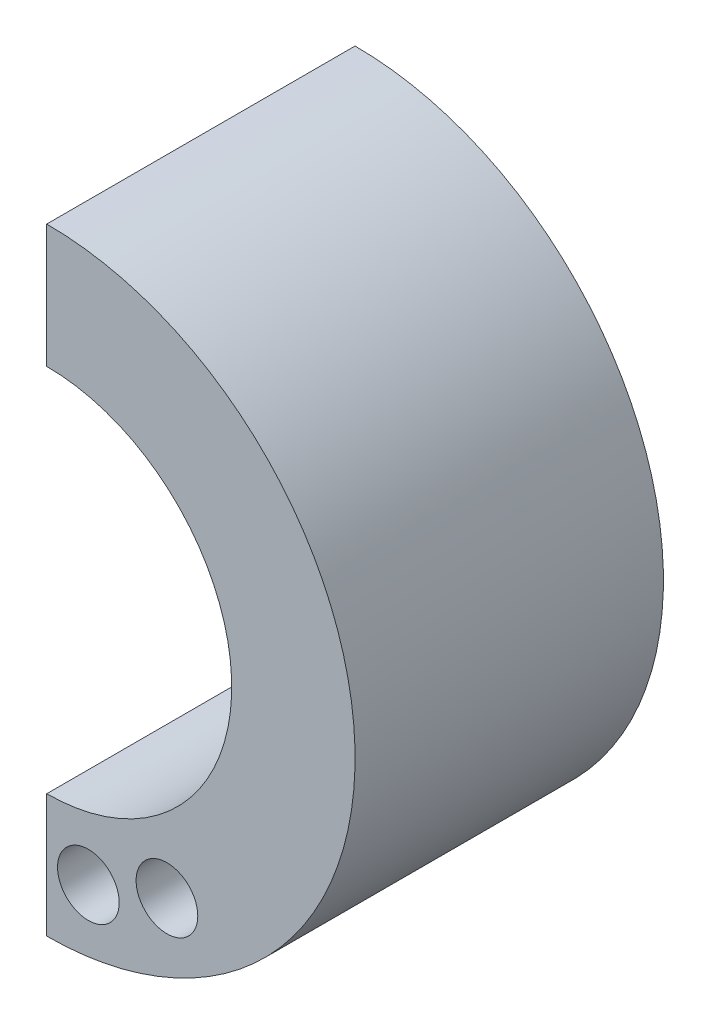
from build123d import *

# Parameters (mm, degrees)
LINEAR_AUSTRAGEN1_DEPTH         = 50
SKIZZE4_R                       = 5
SCHNITT_LINEAR_AUSTRAGEN1_DEPTH = 50
SKIZZE5_R                       = 5
SCHNITT_LINEAR_AUSTRAGEN2_DEPTH = 50
SCHNITT_LINEAR_AUSTRAGEN3_DEPTH = 50


with BuildPart() as part:
    # Skizze1 → Linear austragen1 (new body)
    with BuildSketch(Plane.XY):
        with BuildLine():
            Line((0, 50), (0, -50))
            ThreePointArc((0, -50), (50, 0), (0, 50))
        make_face()
    extrude(amount=LINEAR_AUSTRAGEN1_DEPTH)

    # Skizze4 → Schnitt-Linear austragen1 (cut)
    with BuildSketch(Plane.XY.offset(50)):
        with Locations((6.752762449, -39.425882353)):
            Circle(SKIZZE4_R)
    extrude(amount=-SCHNITT_LINEAR_AUSTRAGEN1_DEPTH, mode=Mode.SUBTRACT)

    # Skizze5 → Schnitt-Linear austragen2 (cut)
    with BuildSketch(Plane.XY.offset(50)):
        with Locations((19.492615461, -34.929041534)):
            Circle(SKIZZE5_R)
    extrude(amount=-SCHNITT_LINEAR_AUSTRAGEN2_DEPTH, mode=Mode.SUBTRACT)

    # Skizze6 → Schnitt-Linear austragen3 (cut)
    with BuildSketch(Plane.XY.offset(50)):
        with BuildLine():
            Line((0, 30), (0, -30))
            ThreePointArc((0, -30), (30, 0), (0, 30))
        make_face()
    extrude(amount=-SCHNITT_LINEAR_AUSTRAGEN3_DEPTH, mode=Mode.SUBTRACT)


solid = part.part
